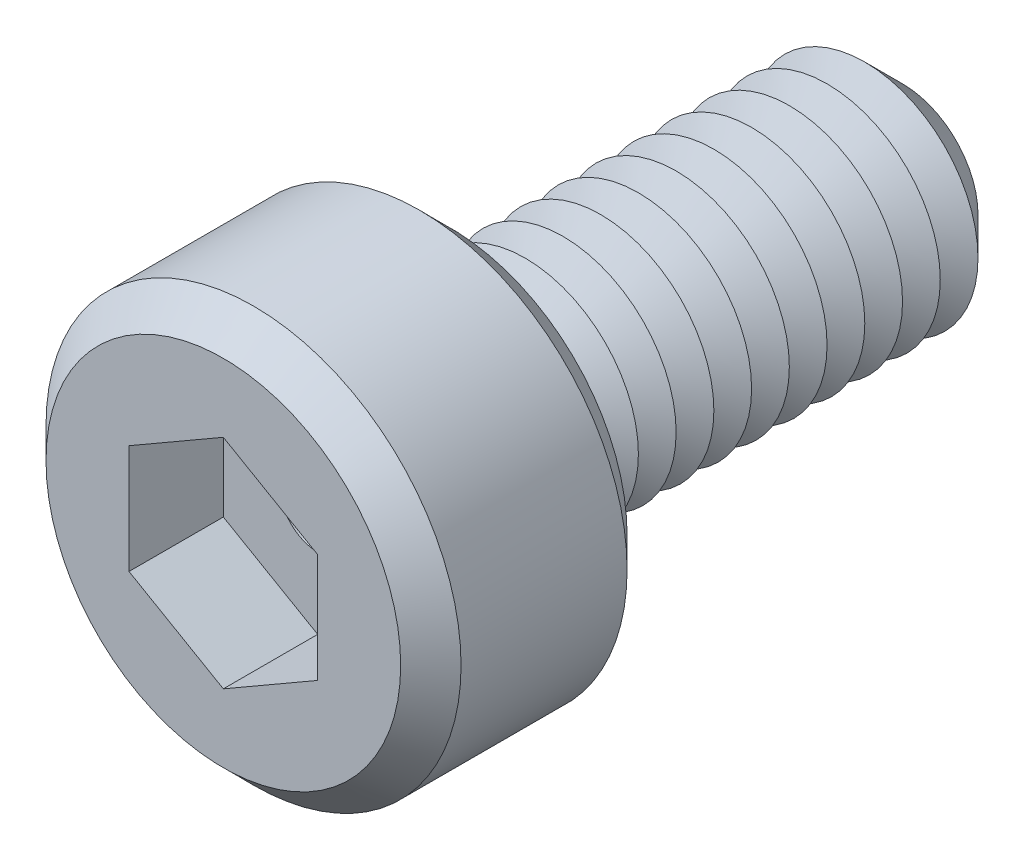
from build123d import *

# Parameters (mm, degrees)
SKETCH1_R           = 2.75
BOSS_EXTRUDE1_DEPTH = 3
SKETCH2_R           = 1.5
BOSS_EXTRUDE2_DEPTH = 6
CHAMFER1_SIZE       = 0.5
LPATTERN1_COUNT     = 11
LPATTERN1_PITCH     = 0.5
CUT_EXTRUDE1_DEPTH  = 1.25
SKETCH6_R           = 0.5
CUT_EXTRUDE2_DEPTH  = 7.75
CHAMFER2_SIZE       = 0.4


with BuildPart() as part:
    # Sketch1 → Boss-Extrude1 (new body)
    with BuildSketch(Plane.XY):
        Circle(SKETCH1_R)
    extrude(amount=BOSS_EXTRUDE1_DEPTH)

    # Sketch2 → Boss-Extrude2 (add)
    with BuildSketch(Plane(origin=(0, 0, 0), x_dir=(-1, 0, 0), z_dir=(0, 0, -1))):
        Circle(SKETCH2_R)
    extrude(amount=BOSS_EXTRUDE2_DEPTH)

    # Chamfer1
    chamfer1_edges = [part.edges().sort_by_distance(p)[0] for p in [
        (1.5, 0, -6),
    ]]
    chamfer(chamfer1_edges, length=CHAMFER1_SIZE)

    # Sketch4 → Cut-Revolve1 (revolve, cut)
    with BuildSketch(Plane(origin=(0, 0, 0), x_dir=(0, 0, -1), z_dir=(1, 0, 0)), mode=Mode.PRIVATE) as cut_revolve1_sk:
        Polygon((0, 1.5), (0.25, 1.066987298), (0.5, 1.5), align=None)
    cut_revolve1 = revolve(cut_revolve1_sk.sketch.rotate(Axis((0, 0, 2.512122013), (0, 0, -1)), 90), axis=Axis((0, 0, 2.512122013), (0, 0, -1)), mode=Mode.SUBTRACT)

    # LPattern1: Cut-Revolve1 ×11
    with Locations(*[(0, 0, -i * LPATTERN1_PITCH) for i in range(1, LPATTERN1_COUNT)]):
        add(cut_revolve1, mode=Mode.SUBTRACT)

    # Sketch5 → Cut-Extrude1 (cut)
    with BuildSketch(Plane.XY.offset(3)):
        Polygon((0, 1.443375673), (-1.25, 0.721687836), (-1.25, -0.721687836), (0, -1.443375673), (1.25, -0.721687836), (1.25, 0.721687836), align=None)
    extrude(amount=-CUT_EXTRUDE1_DEPTH, mode=Mode.SUBTRACT)

    # Sketch6 → Cut-Extrude2 (cut)
    with BuildSketch(Plane.XY.offset(1.75)):
        Circle(SKETCH6_R)
    extrude(amount=-CUT_EXTRUDE2_DEPTH, mode=Mode.SUBTRACT)

    # Chamfer2
    chamfer2_edges = [part.edges().sort_by_distance(p)[0] for p in [
        (-2.75, 0, 0),
        (-2.75, 0, 3),
    ]]
    chamfer(chamfer2_edges, length=CHAMFER2_SIZE)


solid = part.part
